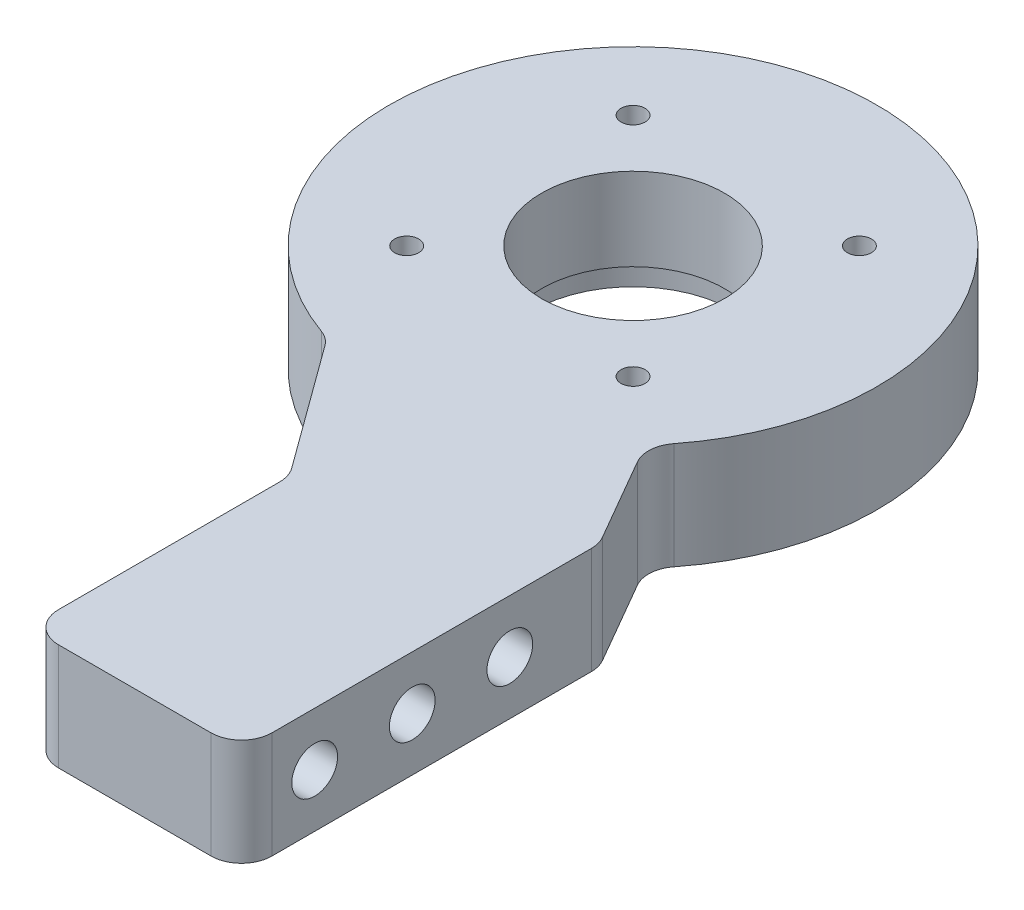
from build123d import *

# Parameters (mm, degrees)
BOSS_EXTRUDE1_DEPTH = 22.225
SKETCH5_R           = 19.05
CUT_EXTRUDE1_DEPTH  = 38.1
SKETCH9_R           = 2.5
CUT_EXTRUDE4_DEPTH  = 42.672
SKETCH12_R          = 4.7625
CUT_EXTRUDE5_DEPTH  = 31.75
FILLET1_R           = 6.35
SKETCH13_R          = 21
CUT_EXTRUDE6_DEPTH  = 5


with BuildPart() as part:
    # Sketch4 → Boss-Extrude1 (new body)
    with BuildSketch(Plane(origin=(0, 0, 0), x_dir=(1, 0, 0), z_dir=(0, 1, 0))):
        with BuildLine():
            Line((50.23011314, -27.714970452), (37.175761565, -5.104170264))
            ThreePointArc((37.175761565, -5.104170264), (-12.950707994, 78.638146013), (-15.274627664, -18.932535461))
            Line((-15.274627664, -18.932535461), (5.78011314, -47.805487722))
            Line((5.78011314, -47.805487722), (5.78011314, -102.256050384))
            Line((5.78011314, -102.256050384), (22.839163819, -102.256050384))
            Line((22.839163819, -102.256050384), (50.23011314, -102.256050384))
            Line((50.23011314, -102.256050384), (50.23011314, -80.316672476))
            Line((50.23011314, -80.316672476), (50.23011314, -27.714970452))
        make_face()
    extrude(amount=BOSS_EXTRUDE1_DEPTH)

    # Sketch5 → Cut-Extrude1 (cut)
    with BuildSketch(Plane(origin=(0, 22.225, 0), x_dir=(1, 0, 0), z_dir=(0, 1, 0))):
        with Locations(Location((0, 29.516672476, 0), (0, 0, 270))):
            Circle(SKETCH5_R)
    extrude(amount=-CUT_EXTRUDE1_DEPTH, mode=Mode.SUBTRACT)

    # Sketch9 → Cut-Extrude4 (cut)
    with BuildSketch(Plane.XZ):
        with Locations(Location((-23.57, -5.946672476, 0), (0, 0, 270))):
            Circle(SKETCH9_R)
        with Locations(Location((23.57, -5.946672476, 0), (0, 0, 270))):
            Circle(SKETCH9_R)
        with Locations(Location((-23.57, -53.086672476, 0), (0, 0, 270))):
            Circle(SKETCH9_R)
        with Locations(Location((23.57, -53.086672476, 0), (0, 0, 270))):
            Circle(SKETCH9_R)
    extrude(amount=-CUT_EXTRUDE4_DEPTH, mode=Mode.SUBTRACT)

    # Sketch12 → Cut-Extrude5 (cut)
    with BuildSketch(Plane(origin=(50.23011314, 0, 0), x_dir=(0, 0, -1), z_dir=(1, 0, 0))):
        with Locations((-87.016050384, 11.1125)):
            Circle(SKETCH12_R)
        with Locations((-66.696050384, 11.1125)):
            Circle(SKETCH12_R)
        with Locations((-46.376050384, 11.1125)):
            Circle(SKETCH12_R)
    extrude(amount=-CUT_EXTRUDE5_DEPTH, mode=Mode.SUBTRACT)

    # Fillet1
    fillet1_edges = [part.edges().sort_by_distance(p)[0] for p in [
        (37.175761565, 11.1125, 5.104170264),
        (50.23011314, 11.1125, 27.714970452),
        (50.23011314, 11.1125, 102.256050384),
        (5.78011314, 11.1125, 102.256050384),
        (5.78011314, 11.1125, 47.805487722),
        (-15.274627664, 11.1125, 18.932535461),
    ]]
    fillet(fillet1_edges, radius=FILLET1_R)

    # Sketch13 → Cut-Extrude6 (cut)
    with BuildSketch(Plane.XZ):
        with Locations(Location((0, -29.516672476, 0), (0, 0, 270))):
            Circle(SKETCH13_R)
    extrude(amount=-CUT_EXTRUDE6_DEPTH, mode=Mode.SUBTRACT)


solid = part.part
